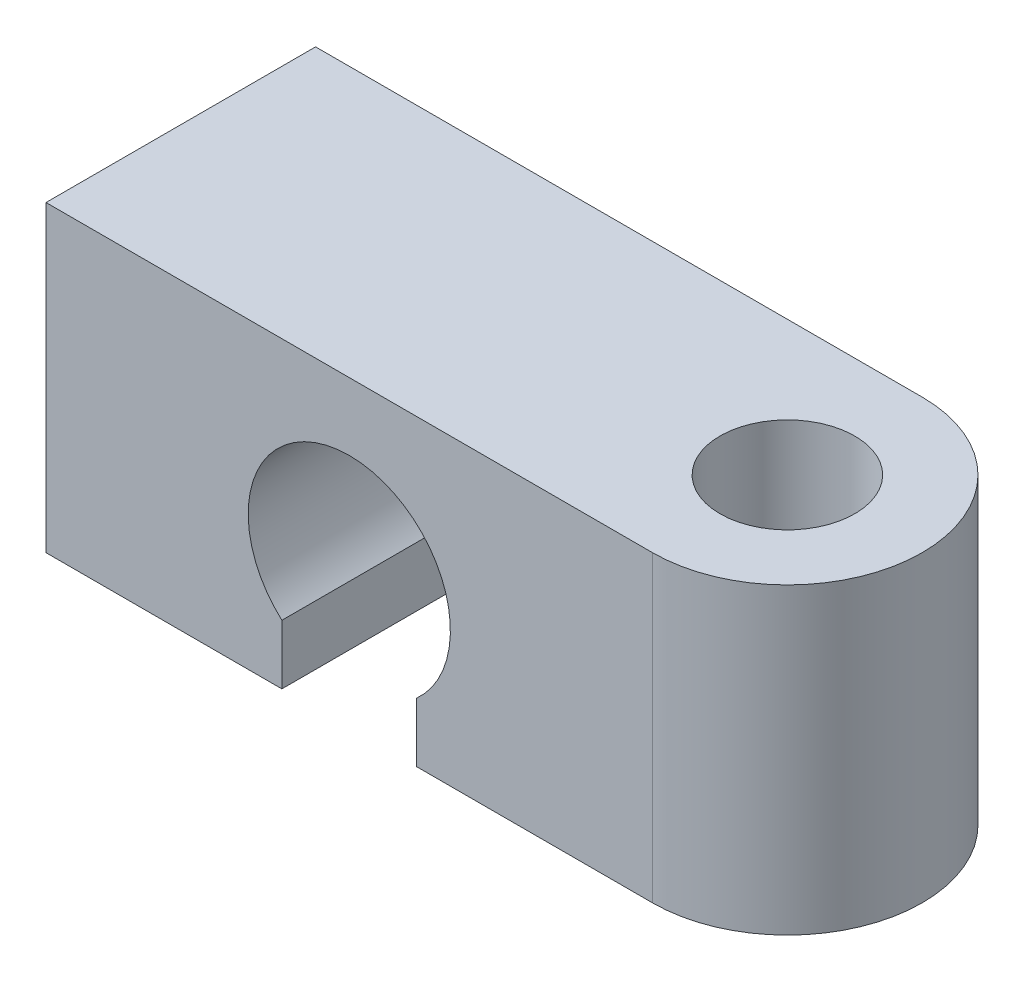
from build123d import *

# Parameters (mm, degrees)
BOSS_EXTRUDE1_DEPTH      = 2
BOSS_EXTRUDE2_DEPTH      = 4.5
F_2_0_2_DIAMETER_HOLE1_D = 2


with BuildPart() as part:
    # Sketch1 → Boss-Extrude1 (new, symmetric)
    with BuildSketch(Plane.XY):
        with BuildLine():
            Line((-1, -1.118033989), (-1, -2))
            Line((-1, -2), (-4.5, -2))
            Line((-4.5, -2), (-4.5, 2.5))
            Line((-4.5, 2.5), (4.5, 2.5))
            Line((4.5, 2.5), (4.5, -2))
            Line((4.5, -2), (1, -2))
            Line((1, -2), (1, -1.118033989))
            ThreePointArc((1, -1.118033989), (0, 1.5), (-1, -1.118033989))
        make_face()
    extrude(amount=BOSS_EXTRUDE1_DEPTH, both=True)

    # Sketch2 → Boss-Extrude2 (add)
    with BuildSketch(Plane(origin=(0, 2.5, 0), x_dir=(1, 0, 0), z_dir=(0, 1, 0))):
        with BuildLine():
            Line((4.5, -2), (4.5, 2))
            ThreePointArc((4.5, 2), (6.5, 0), (4.5, -2))
        make_face()
    extrude(amount=-BOSS_EXTRUDE2_DEPTH)

    # 2.0 _2_ Diameter Hole1 (through all)
    with Locations(Plane(origin=(-9, 2.5, 2), x_dir=(-1, 0, 0), z_dir=(0, 1, 0))):
        with Locations((-13.5, -2)):
            Hole(F_2_0_2_DIAMETER_HOLE1_D / 2)


solid = part.part
